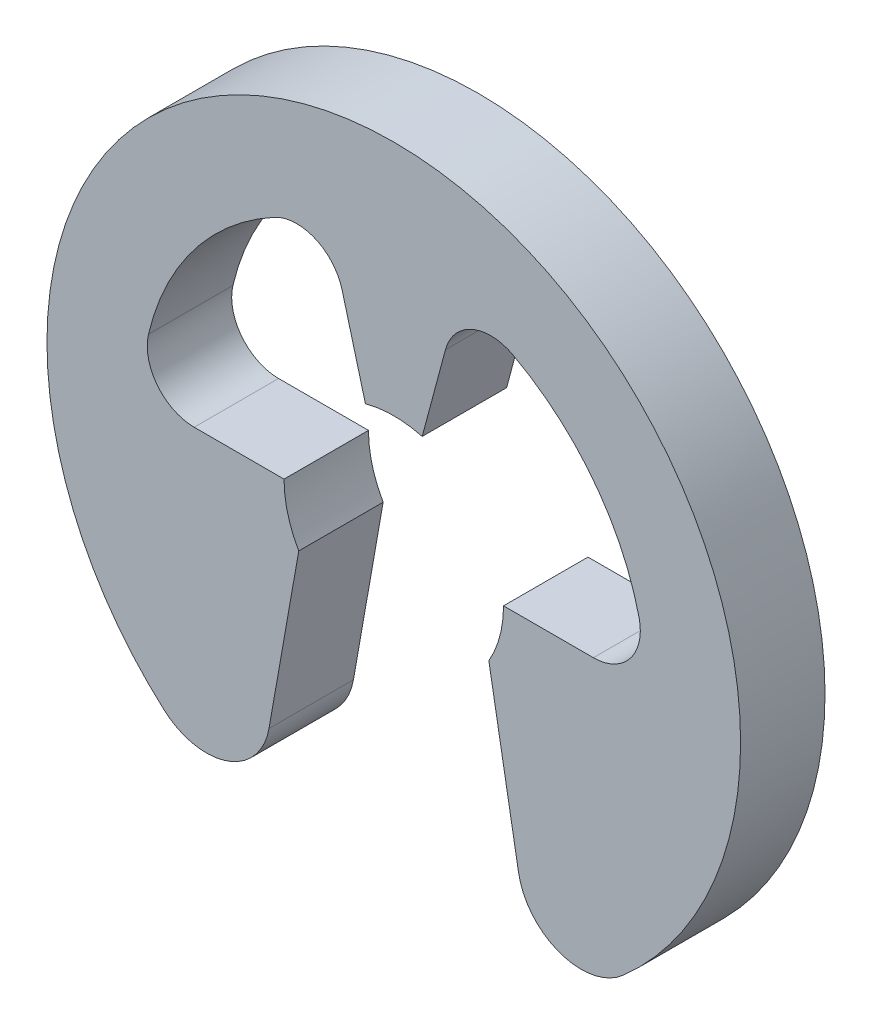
ISO-10303-21;
HEADER;
FILE_DESCRIPTION(('STEP AP214'),'2;1');
FILE_NAME('part.step','',(''),(''),'','','');
FILE_SCHEMA(('AUTOMOTIVE_DESIGN { 1 0 10303 214 1 1 1 1 }'));
ENDSEC;
DATA;
#1=APPLICATION_CONTEXT('core data for automotive mechanical design processes');
#2=APPLICATION_PROTOCOL_DEFINITION('international standard','automotive_design',2000,#1);
#3=PRODUCT_CONTEXT('',#1,'mechanical');
#4=PRODUCT('Part','Part','',(#3));
#5=PRODUCT_RELATED_PRODUCT_CATEGORY('part','',(#4));
#6=PRODUCT_DEFINITION_FORMATION('','',#4);
#7=PRODUCT_DEFINITION_CONTEXT('part definition',#1,'design');
#8=PRODUCT_DEFINITION('design','',#6,#7);
#9=PRODUCT_DEFINITION_SHAPE('','',#8);
#10=(LENGTH_UNIT() NAMED_UNIT(*) SI_UNIT(.MILLI.,.METRE.));
#11=(NAMED_UNIT(*) PLANE_ANGLE_UNIT() SI_UNIT($,.RADIAN.));
#12=(NAMED_UNIT(*) SI_UNIT($,.STERADIAN.) SOLID_ANGLE_UNIT());
#13=UNCERTAINTY_MEASURE_WITH_UNIT(LENGTH_MEASURE(1.E-05),#10,'distance_accuracy_value','');
#14=(GEOMETRIC_REPRESENTATION_CONTEXT(3) GLOBAL_UNCERTAINTY_ASSIGNED_CONTEXT((#13)) GLOBAL_UNIT_ASSIGNED_CONTEXT((#10,
#11,#12)) REPRESENTATION_CONTEXT('',''));
#15=CARTESIAN_POINT('',(0.,0.,0.));
#16=DIRECTION('',(0.,0.,1.));
#17=DIRECTION('',(1.,0.,0.));
#18=AXIS2_PLACEMENT_3D('',#15,#16,#17);
#19=CARTESIAN_POINT('',(0.600538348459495,0.141219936,-0.254));
#20=DIRECTION('',(0.,0.,1.));
#21=DIRECTION('',(1.,0.,0.));
#22=AXIS2_PLACEMENT_3D('',#19,#20,#21);
#23=CYLINDRICAL_SURFACE('',#22,0.141219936);
#24=CARTESIAN_POINT('',(0.600538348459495,0.141219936,0.));
#25=DIRECTION('',(0.,0.,-1.));
#26=DIRECTION('',(1.,0.,0.));
#27=AXIS2_PLACEMENT_3D('',#24,#25,#26);
#28=CIRCLE('',#27,0.141219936);
#29=CARTESIAN_POINT('',(0.73800850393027,0.173546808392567,0.));
#30=VERTEX_POINT('',#29);
#31=CARTESIAN_POINT('',(0.600538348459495,0.,0.));
#32=VERTEX_POINT('',#31);
#33=EDGE_CURVE('E198',#30,#32,#28,.T.);
#34=ORIENTED_EDGE('',*,*,#33,.F.);
#35=DIRECTION('',(0.,0.,1.));
#36=VECTOR('',#35,1.);
#37=CARTESIAN_POINT('',(0.73800850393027,0.173546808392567,-0.254));
#38=LINE('',#37,#36);
#39=CARTESIAN_POINT('',(0.73800850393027,0.173546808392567,-0.254));
#40=VERTEX_POINT('',#39);
#41=EDGE_CURVE('E11',#40,#30,#38,.T.);
#42=ORIENTED_EDGE('',*,*,#41,.F.);
#43=CARTESIAN_POINT('',(0.600538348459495,0.141219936,-0.254));
#44=DIRECTION('',(0.,0.,-1.));
#45=DIRECTION('',(1.,0.,0.));
#46=AXIS2_PLACEMENT_3D('',#43,#44,#45);
#47=CIRCLE('',#46,0.141219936);
#48=CARTESIAN_POINT('',(0.600538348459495,0.,-0.254));
#49=VERTEX_POINT('',#48);
#50=EDGE_CURVE('E248',#40,#49,#47,.T.);
#51=ORIENTED_EDGE('',*,*,#50,.T.);
#52=DIRECTION('',(0.,0.,1.));
#53=VECTOR('',#52,1.);
#54=CARTESIAN_POINT('',(0.600538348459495,0.,-0.254));
#55=LINE('',#54,#53);
#56=EDGE_CURVE('E45',#49,#32,#55,.T.);
#57=ORIENTED_EDGE('',*,*,#56,.T.);
#58=EDGE_LOOP('',(#34,#42,#51,#57));
#59=FACE_BOUND('',#58,.T.);
#60=ADVANCED_FACE('F39',(#59),#23,.F.);
#61=CARTESIAN_POINT('',(0.,0.,-0.254));
#62=DIRECTION('',(0.,0.,1.));
#63=DIRECTION('',(1.,0.,0.));
#64=AXIS2_PLACEMENT_3D('',#61,#62,#63);
#65=CYLINDRICAL_SURFACE('',#64,0.758139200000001);
#66=CARTESIAN_POINT('',(0.,0.,0.));
#67=DIRECTION('',(0.,0.,-1.));
#68=DIRECTION('',(1.,0.,0.));
#69=AXIS2_PLACEMENT_3D('',#66,#67,#68);
#70=CIRCLE('',#69,0.758139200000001);
#71=CARTESIAN_POINT('',(0.358644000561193,0.667944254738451,0.));
#72=VERTEX_POINT('',#71);
#73=EDGE_CURVE('E243',#72,#30,#70,.T.);
#74=ORIENTED_EDGE('',*,*,#73,.F.);
#75=DIRECTION('',(0.,0.,1.));
#76=VECTOR('',#75,1.);
#77=CARTESIAN_POINT('',(0.358644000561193,0.667944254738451,-0.254));
#78=LINE('',#77,#76);
#79=CARTESIAN_POINT('',(0.358644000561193,0.667944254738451,-0.254));
#80=VERTEX_POINT('',#79);
#81=EDGE_CURVE('E48',#80,#72,#78,.T.);
#82=ORIENTED_EDGE('',*,*,#81,.F.);
#83=CARTESIAN_POINT('',(0.,0.,-0.254));
#84=DIRECTION('',(0.,0.,-1.));
#85=DIRECTION('',(1.,0.,0.));
#86=AXIS2_PLACEMENT_3D('',#83,#84,#85);
#87=CIRCLE('',#86,0.758139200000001);
#88=EDGE_CURVE('E186',#80,#40,#87,.T.);
#89=ORIENTED_EDGE('',*,*,#88,.T.);
#90=ORIENTED_EDGE('',*,*,#41,.T.);
#91=EDGE_LOOP('',(#74,#82,#89,#90));
#92=FACE_BOUND('',#91,.T.);
#93=ADVANCED_FACE('F279',(#92),#65,.F.);
#94=CARTESIAN_POINT('',(0.291838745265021,0.543525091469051,-0.254));
#95=DIRECTION('',(0.,0.,1.));
#96=DIRECTION('',(1.,0.,0.));
#97=AXIS2_PLACEMENT_3D('',#94,#95,#96);
#98=CYLINDRICAL_SURFACE('',#97,0.141219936);
#99=CARTESIAN_POINT('',(0.291838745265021,0.543525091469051,0.));
#100=DIRECTION('',(0.,0.,-1.));
#101=DIRECTION('',(1.,0.,0.));
#102=AXIS2_PLACEMENT_3D('',#99,#100,#101);
#103=CIRCLE('',#102,0.141219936);
#104=CARTESIAN_POINT('',(0.155430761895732,0.580075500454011,0.));
#105=VERTEX_POINT('',#104);
#106=EDGE_CURVE('E174',#105,#72,#103,.T.);
#107=ORIENTED_EDGE('',*,*,#106,.F.);
#108=DIRECTION('',(0.,0.,1.));
#109=VECTOR('',#108,1.);
#110=CARTESIAN_POINT('',(0.155430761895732,0.580075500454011,-0.254));
#111=LINE('',#110,#109);
#112=CARTESIAN_POINT('',(0.155430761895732,0.580075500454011,-0.254));
#113=VERTEX_POINT('',#112);
#114=EDGE_CURVE('E169',#113,#105,#111,.T.);
#115=ORIENTED_EDGE('',*,*,#114,.F.);
#116=CARTESIAN_POINT('',(0.291838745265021,0.543525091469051,-0.254));
#117=DIRECTION('',(0.,0.,-1.));
#118=DIRECTION('',(1.,0.,0.));
#119=AXIS2_PLACEMENT_3D('',#116,#117,#118);
#120=CIRCLE('',#119,0.141219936);
#121=EDGE_CURVE('E171',#113,#80,#120,.T.);
#122=ORIENTED_EDGE('',*,*,#121,.T.);
#123=ORIENTED_EDGE('',*,*,#81,.T.);
#124=EDGE_LOOP('',(#107,#115,#122,#123));
#125=FACE_BOUND('',#124,.T.);
#126=ADVANCED_FACE('F168',(#125),#98,.F.);
#127=CARTESIAN_POINT('',(0.0854620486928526,0.31894870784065,-0.254));
#128=DIRECTION('',(0.965925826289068,-0.258819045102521,0.));
#129=DIRECTION('',(0.258819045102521,0.965925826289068,0.));
#130=AXIS2_PLACEMENT_3D('',#127,#128,#129);
#131=PLANE('',#130);
#132=DIRECTION('',(0.258819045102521,0.965925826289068,0.));
#133=VECTOR('',#132,1.);
#134=CARTESIAN_POINT('',(0.0854620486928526,0.31894870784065,0.));
#135=LINE('',#134,#133);
#136=CARTESIAN_POINT('',(0.0854620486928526,0.31894870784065,0.));
#137=VERTEX_POINT('',#136);
#138=EDGE_CURVE('E241',#137,#105,#135,.T.);
#139=ORIENTED_EDGE('',*,*,#138,.F.);
#140=DIRECTION('',(0.,0.,1.));
#141=VECTOR('',#140,1.);
#142=CARTESIAN_POINT('',(0.0854620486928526,0.31894870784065,-0.254));
#143=LINE('',#142,#141);
#144=CARTESIAN_POINT('',(0.0854620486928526,0.31894870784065,-0.254));
#145=VERTEX_POINT('',#144);
#146=EDGE_CURVE('E177',#145,#137,#143,.T.);
#147=ORIENTED_EDGE('',*,*,#146,.F.);
#148=DIRECTION('',(0.258819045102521,0.965925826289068,0.));
#149=VECTOR('',#148,1.);
#150=CARTESIAN_POINT('',(0.0854620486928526,0.31894870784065,-0.254));
#151=LINE('',#150,#149);
#152=EDGE_CURVE('E184',#145,#113,#151,.T.);
#153=ORIENTED_EDGE('',*,*,#152,.T.);
#154=ORIENTED_EDGE('',*,*,#114,.T.);
#155=EDGE_LOOP('',(#139,#147,#153,#154));
#156=FACE_BOUND('',#155,.T.);
#157=ADVANCED_FACE('F187',(#156),#131,.T.);
#158=CARTESIAN_POINT('',(0.,0.,-0.254));
#159=DIRECTION('',(0.,0.,1.));
#160=DIRECTION('',(1.,0.,0.));
#161=AXIS2_PLACEMENT_3D('',#158,#159,#160);
#162=CYLINDRICAL_SURFACE('',#161,0.3302);
#163=CARTESIAN_POINT('',(0.,0.,0.));
#164=DIRECTION('',(0.,0.,-1.));
#165=DIRECTION('',(-1.,0.,0.));
#166=AXIS2_PLACEMENT_3D('',#163,#164,#165);
#167=CIRCLE('',#166,0.3302);
#168=CARTESIAN_POINT('',(-0.0854620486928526,0.31894870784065,0.));
#169=VERTEX_POINT('',#168);
#170=EDGE_CURVE('E236',#169,#137,#167,.T.);
#171=ORIENTED_EDGE('',*,*,#170,.F.);
#172=DIRECTION('',(0.,0.,1.));
#173=VECTOR('',#172,1.);
#174=CARTESIAN_POINT('',(-0.0854620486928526,0.31894870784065,-0.254));
#175=LINE('',#174,#173);
#176=CARTESIAN_POINT('',(-0.0854620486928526,0.31894870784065,-0.254));
#177=VERTEX_POINT('',#176);
#178=EDGE_CURVE('E247',#177,#169,#175,.T.);
#179=ORIENTED_EDGE('',*,*,#178,.F.);
#180=CARTESIAN_POINT('',(0.,0.,-0.254));
#181=DIRECTION('',(0.,0.,-1.));
#182=DIRECTION('',(-1.,0.,0.));
#183=AXIS2_PLACEMENT_3D('',#180,#181,#182);
#184=CIRCLE('',#183,0.3302);
#185=EDGE_CURVE('E188',#177,#145,#184,.T.);
#186=ORIENTED_EDGE('',*,*,#185,.T.);
#187=ORIENTED_EDGE('',*,*,#146,.T.);
#188=EDGE_LOOP('',(#171,#179,#186,#187));
#189=FACE_BOUND('',#188,.T.);
#190=ADVANCED_FACE('F292',(#189),#162,.F.);
#191=CARTESIAN_POINT('',(-0.0854620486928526,0.31894870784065,-0.254));
#192=DIRECTION('',(-0.965925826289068,-0.258819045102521,0.));
#193=DIRECTION('',(0.258819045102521,-0.965925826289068,0.));
#194=AXIS2_PLACEMENT_3D('',#191,#192,#193);
#195=PLANE('',#194);
#196=DIRECTION('',(0.258819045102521,-0.965925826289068,0.));
#197=VECTOR('',#196,1.);
#198=CARTESIAN_POINT('',(-0.0854620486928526,0.31894870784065,0.));
#199=LINE('',#198,#197);
#200=CARTESIAN_POINT('',(-0.155430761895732,0.580075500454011,0.));
#201=VERTEX_POINT('',#200);
#202=EDGE_CURVE('E231',#201,#169,#199,.T.);
#203=ORIENTED_EDGE('',*,*,#202,.F.);
#204=DIRECTION('',(0.,0.,1.));
#205=VECTOR('',#204,1.);
#206=CARTESIAN_POINT('',(-0.155430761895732,0.580075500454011,-0.254));
#207=LINE('',#206,#205);
#208=CARTESIAN_POINT('',(-0.155430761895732,0.580075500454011,-0.254));
#209=VERTEX_POINT('',#208);
#210=EDGE_CURVE('E252',#209,#201,#207,.T.);
#211=ORIENTED_EDGE('',*,*,#210,.F.);
#212=DIRECTION('',(0.258819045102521,-0.965925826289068,0.));
#213=VECTOR('',#212,1.);
#214=CARTESIAN_POINT('',(-0.0854620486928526,0.31894870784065,-0.254));
#215=LINE('',#214,#213);
#216=EDGE_CURVE('E193',#209,#177,#215,.T.);
#217=ORIENTED_EDGE('',*,*,#216,.T.);
#218=ORIENTED_EDGE('',*,*,#178,.T.);
#219=EDGE_LOOP('',(#203,#211,#217,#218));
#220=FACE_BOUND('',#219,.T.);
#221=ADVANCED_FACE('F294',(#220),#195,.T.);
#222=CARTESIAN_POINT('',(-0.291838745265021,0.543525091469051,-0.254));
#223=DIRECTION('',(0.,0.,1.));
#224=DIRECTION('',(1.,0.,0.));
#225=AXIS2_PLACEMENT_3D('',#222,#223,#224);
#226=CYLINDRICAL_SURFACE('',#225,0.141219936);
#227=CARTESIAN_POINT('',(-0.291838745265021,0.543525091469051,0.));
#228=DIRECTION('',(0.,0.,-1.));
#229=DIRECTION('',(1.,0.,0.));
#230=AXIS2_PLACEMENT_3D('',#227,#228,#229);
#231=CIRCLE('',#230,0.141219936);
#232=CARTESIAN_POINT('',(-0.358644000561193,0.667944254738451,0.));
#233=VERTEX_POINT('',#232);
#234=EDGE_CURVE('E234',#233,#201,#231,.T.);
#235=ORIENTED_EDGE('',*,*,#234,.F.);
#236=DIRECTION('',(0.,0.,1.));
#237=VECTOR('',#236,1.);
#238=CARTESIAN_POINT('',(-0.358644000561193,0.667944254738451,-0.254));
#239=LINE('',#238,#237);
#240=CARTESIAN_POINT('',(-0.358644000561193,0.667944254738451,-0.254));
#241=VERTEX_POINT('',#240);
#242=EDGE_CURVE('E255',#241,#233,#239,.T.);
#243=ORIENTED_EDGE('',*,*,#242,.F.);
#244=CARTESIAN_POINT('',(-0.291838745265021,0.543525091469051,-0.254));
#245=DIRECTION('',(0.,0.,-1.));
#246=DIRECTION('',(1.,0.,0.));
#247=AXIS2_PLACEMENT_3D('',#244,#245,#246);
#248=CIRCLE('',#247,0.141219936);
#249=EDGE_CURVE('E465',#241,#209,#248,.T.);
#250=ORIENTED_EDGE('',*,*,#249,.T.);
#251=ORIENTED_EDGE('',*,*,#210,.T.);
#252=EDGE_LOOP('',(#235,#243,#250,#251));
#253=FACE_BOUND('',#252,.T.);
#254=ADVANCED_FACE('F297',(#253),#226,.F.);
#255=CARTESIAN_POINT('',(0.,0.,-0.254));
#256=DIRECTION('',(0.,0.,1.));
#257=DIRECTION('',(1.,0.,0.));
#258=AXIS2_PLACEMENT_3D('',#255,#256,#257);
#259=CYLINDRICAL_SURFACE('',#258,0.758139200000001);
#260=CARTESIAN_POINT('',(0.,0.,0.));
#261=DIRECTION('',(0.,0.,-1.));
#262=DIRECTION('',(1.,0.,0.));
#263=AXIS2_PLACEMENT_3D('',#260,#261,#262);
#264=CIRCLE('',#263,0.758139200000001);
#265=CARTESIAN_POINT('',(-0.73800850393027,0.173546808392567,0.));
#266=VERTEX_POINT('',#265);
#267=EDGE_CURVE('E228',#266,#233,#264,.T.);
#268=ORIENTED_EDGE('',*,*,#267,.F.);
#269=DIRECTION('',(0.,0.,1.));
#270=VECTOR('',#269,1.);
#271=CARTESIAN_POINT('',(-0.73800850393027,0.173546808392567,-0.254));
#272=LINE('',#271,#270);
#273=CARTESIAN_POINT('',(-0.73800850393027,0.173546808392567,-0.254));
#274=VERTEX_POINT('',#273);
#275=EDGE_CURVE('E258',#274,#266,#272,.T.);
#276=ORIENTED_EDGE('',*,*,#275,.F.);
#277=CARTESIAN_POINT('',(0.,0.,-0.254));
#278=DIRECTION('',(0.,0.,-1.));
#279=DIRECTION('',(1.,0.,0.));
#280=AXIS2_PLACEMENT_3D('',#277,#278,#279);
#281=CIRCLE('',#280,0.758139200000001);
#282=EDGE_CURVE('E468',#274,#241,#281,.T.);
#283=ORIENTED_EDGE('',*,*,#282,.T.);
#284=ORIENTED_EDGE('',*,*,#242,.T.);
#285=EDGE_LOOP('',(#268,#276,#283,#284));
#286=FACE_BOUND('',#285,.T.);
#287=ADVANCED_FACE('F305',(#286),#259,.F.);
#288=CARTESIAN_POINT('',(-0.600538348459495,0.141219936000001,-0.254));
#289=DIRECTION('',(0.,0.,1.));
#290=DIRECTION('',(1.,0.,0.));
#291=AXIS2_PLACEMENT_3D('',#288,#289,#290);
#292=CYLINDRICAL_SURFACE('',#291,0.141219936);
#293=CARTESIAN_POINT('',(-0.600538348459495,0.141219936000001,0.));
#294=DIRECTION('',(0.,0.,-1.));
#295=DIRECTION('',(1.,0.,0.));
#296=AXIS2_PLACEMENT_3D('',#293,#294,#295);
#297=CIRCLE('',#296,0.141219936);
#298=CARTESIAN_POINT('',(-0.600538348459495,0.,0.));
#299=VERTEX_POINT('',#298);
#300=EDGE_CURVE('E226',#299,#266,#297,.T.);
#301=ORIENTED_EDGE('',*,*,#300,.F.);
#302=DIRECTION('',(0.,0.,1.));
#303=VECTOR('',#302,1.);
#304=CARTESIAN_POINT('',(-0.600538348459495,0.,-0.254));
#305=LINE('',#304,#303);
#306=CARTESIAN_POINT('',(-0.600538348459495,0.,-0.254));
#307=VERTEX_POINT('',#306);
#308=EDGE_CURVE('E256',#307,#299,#305,.T.);
#309=ORIENTED_EDGE('',*,*,#308,.F.);
#310=CARTESIAN_POINT('',(-0.600538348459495,0.141219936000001,-0.254));
#311=DIRECTION('',(0.,0.,-1.));
#312=DIRECTION('',(1.,0.,0.));
#313=AXIS2_PLACEMENT_3D('',#310,#311,#312);
#314=CIRCLE('',#313,0.141219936);
#315=EDGE_CURVE('E451',#307,#274,#314,.T.);
#316=ORIENTED_EDGE('',*,*,#315,.T.);
#317=ORIENTED_EDGE('',*,*,#275,.T.);
#318=EDGE_LOOP('',(#301,#309,#316,#317));
#319=FACE_BOUND('',#318,.T.);
#320=ADVANCED_FACE('F308',(#319),#292,.F.);
#321=CARTESIAN_POINT('',(-0.3302,0.,-0.254));
#322=DIRECTION('',(0.,1.,0.));
#323=DIRECTION('',(-1.,0.,0.));
#324=AXIS2_PLACEMENT_3D('',#321,#322,#323);
#325=PLANE('',#324);
#326=DIRECTION('',(-1.,0.,0.));
#327=VECTOR('',#326,1.);
#328=CARTESIAN_POINT('',(-0.3302,0.,0.));
#329=LINE('',#328,#327);
#330=CARTESIAN_POINT('',(-0.3302,0.,0.));
#331=VERTEX_POINT('',#330);
#332=EDGE_CURVE('E224',#331,#299,#329,.T.);
#333=ORIENTED_EDGE('',*,*,#332,.F.);
#334=DIRECTION('',(0.,0.,1.));
#335=VECTOR('',#334,1.);
#336=CARTESIAN_POINT('',(-0.3302,0.,-0.254));
#337=LINE('',#336,#335);
#338=CARTESIAN_POINT('',(-0.3302,0.,-0.254));
#339=VERTEX_POINT('',#338);
#340=EDGE_CURVE('E257',#339,#331,#337,.T.);
#341=ORIENTED_EDGE('',*,*,#340,.F.);
#342=DIRECTION('',(-1.,0.,0.));
#343=VECTOR('',#342,1.);
#344=CARTESIAN_POINT('',(-0.3302,0.,-0.254));
#345=LINE('',#344,#343);
#346=EDGE_CURVE('E453',#339,#307,#345,.T.);
#347=ORIENTED_EDGE('',*,*,#346,.T.);
#348=ORIENTED_EDGE('',*,*,#308,.T.);
#349=EDGE_LOOP('',(#333,#341,#347,#348));
#350=FACE_BOUND('',#349,.T.);
#351=ADVANCED_FACE('F309',(#350),#325,.T.);
#352=CARTESIAN_POINT('',(0.,0.,-0.254));
#353=DIRECTION('',(0.,0.,1.));
#354=DIRECTION('',(1.,0.,0.));
#355=AXIS2_PLACEMENT_3D('',#352,#353,#354);
#356=CYLINDRICAL_SURFACE('',#355,0.3302);
#357=CARTESIAN_POINT('',(0.,0.,0.));
#358=DIRECTION('',(0.,0.,-1.));
#359=DIRECTION('',(1.,0.,0.));
#360=AXIS2_PLACEMENT_3D('',#357,#358,#359);
#361=CIRCLE('',#360,0.3302);
#362=CARTESIAN_POINT('',(-0.285961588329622,-0.1651,0.));
#363=VERTEX_POINT('',#362);
#364=EDGE_CURVE('E219',#363,#331,#361,.T.);
#365=ORIENTED_EDGE('',*,*,#364,.F.);
#366=DIRECTION('',(0.,0.,1.));
#367=VECTOR('',#366,1.);
#368=CARTESIAN_POINT('',(-0.285961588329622,-0.1651,-0.254));
#369=LINE('',#368,#367);
#370=CARTESIAN_POINT('',(-0.285961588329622,-0.1651,-0.254));
#371=VERTEX_POINT('',#370);
#372=EDGE_CURVE('E265',#371,#363,#369,.T.);
#373=ORIENTED_EDGE('',*,*,#372,.F.);
#374=CARTESIAN_POINT('',(0.,0.,-0.254));
#375=DIRECTION('',(0.,0.,-1.));
#376=DIRECTION('',(1.,0.,0.));
#377=AXIS2_PLACEMENT_3D('',#374,#375,#376);
#378=CIRCLE('',#377,0.3302);
#379=EDGE_CURVE('E472',#371,#339,#378,.T.);
#380=ORIENTED_EDGE('',*,*,#379,.T.);
#381=ORIENTED_EDGE('',*,*,#340,.T.);
#382=EDGE_LOOP('',(#365,#373,#380,#381));
#383=FACE_BOUND('',#382,.T.);
#384=ADVANCED_FACE('F314',(#383),#356,.F.);
#385=CARTESIAN_POINT('',(-0.285961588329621,-0.1651,-0.254));
#386=DIRECTION('',(0.984807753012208,-0.17364817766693,0.));
#387=DIRECTION('',(0.17364817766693,0.984807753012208,0.));
#388=AXIS2_PLACEMENT_3D('',#385,#386,#387);
#389=PLANE('',#388);
#390=DIRECTION('',(0.17364817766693,0.984807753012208,0.));
#391=VECTOR('',#390,1.);
#392=CARTESIAN_POINT('',(-0.285961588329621,-0.1651,0.));
#393=LINE('',#392,#391);
#394=CARTESIAN_POINT('',(-0.375423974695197,-0.672466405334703,0.));
#395=VERTEX_POINT('',#394);
#396=EDGE_CURVE('E220',#395,#363,#393,.T.);
#397=ORIENTED_EDGE('',*,*,#396,.F.);
#398=DIRECTION('',(0.,0.,1.));
#399=VECTOR('',#398,1.);
#400=CARTESIAN_POINT('',(-0.375423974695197,-0.672466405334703,-0.254));
#401=LINE('',#400,#399);
#402=CARTESIAN_POINT('',(-0.375423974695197,-0.672466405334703,-0.254));
#403=VERTEX_POINT('',#402);
#404=EDGE_CURVE('E262',#403,#395,#401,.T.);
#405=ORIENTED_EDGE('',*,*,#404,.F.);
#406=DIRECTION('',(0.17364817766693,0.984807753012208,0.));
#407=VECTOR('',#406,1.);
#408=CARTESIAN_POINT('',(-0.285961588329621,-0.1651,-0.254));
#409=LINE('',#408,#407);
#410=EDGE_CURVE('E441',#403,#371,#409,.T.);
#411=ORIENTED_EDGE('',*,*,#410,.T.);
#412=ORIENTED_EDGE('',*,*,#372,.T.);
#413=EDGE_LOOP('',(#397,#405,#411,#412));
#414=FACE_BOUND('',#413,.T.);
#415=ADVANCED_FACE('F318',(#414),#389,.T.);
#416=CARTESIAN_POINT('',(-0.563666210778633,-0.639274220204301,-0.254));
#417=DIRECTION('',(0.,0.,1.));
#418=DIRECTION('',(1.,0.,0.));
#419=AXIS2_PLACEMENT_3D('',#416,#417,#418);
#420=CYLINDRICAL_SURFACE('',#419,0.191146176);
#421=CARTESIAN_POINT('',(-0.563666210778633,-0.639274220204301,0.));
#422=DIRECTION('',(0.,0.,1.));
#423=DIRECTION('',(1.,0.,0.));
#424=AXIS2_PLACEMENT_3D('',#421,#422,#423);
#425=CIRCLE('',#424,0.191146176);
#426=CARTESIAN_POINT('',(-0.690082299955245,-0.782647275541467,0.));
#427=VERTEX_POINT('',#426);
#428=EDGE_CURVE('E212',#427,#395,#425,.T.);
#429=ORIENTED_EDGE('',*,*,#428,.F.);
#430=DIRECTION('',(0.,0.,1.));
#431=VECTOR('',#430,1.);
#432=CARTESIAN_POINT('',(-0.690082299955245,-0.782647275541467,-0.254));
#433=LINE('',#432,#431);
#434=CARTESIAN_POINT('',(-0.690082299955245,-0.782647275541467,-0.254));
#435=VERTEX_POINT('',#434);
#436=EDGE_CURVE('E266',#435,#427,#433,.T.);
#437=ORIENTED_EDGE('',*,*,#436,.F.);
#438=CARTESIAN_POINT('',(-0.563666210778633,-0.639274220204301,-0.254));
#439=DIRECTION('',(0.,0.,1.));
#440=DIRECTION('',(1.,0.,0.));
#441=AXIS2_PLACEMENT_3D('',#438,#439,#440);
#442=CIRCLE('',#441,0.191146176);
#443=EDGE_CURVE('E439',#435,#403,#442,.T.);
#444=ORIENTED_EDGE('',*,*,#443,.T.);
#445=ORIENTED_EDGE('',*,*,#404,.T.);
#446=EDGE_LOOP('',(#429,#437,#444,#445));
#447=FACE_BOUND('',#446,.T.);
#448=ADVANCED_FACE('F325',(#447),#420,.T.);
#449=CARTESIAN_POINT('',(0.,0.,-0.254));
#450=DIRECTION('',(0.,0.,1.));
#451=DIRECTION('',(1.,0.,0.));
#452=AXIS2_PLACEMENT_3D('',#449,#450,#451);
#453=CYLINDRICAL_SURFACE('',#452,1.043432);
#454=CARTESIAN_POINT('',(0.,0.,0.));
#455=DIRECTION('',(0.,0.,1.));
#456=DIRECTION('',(1.,0.,0.));
#457=AXIS2_PLACEMENT_3D('',#454,#455,#456);
#458=CIRCLE('',#457,1.043432);
#459=CARTESIAN_POINT('',(0.690082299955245,-0.782647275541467,0.));
#460=VERTEX_POINT('',#459);
#461=EDGE_CURVE('E211',#460,#427,#458,.T.);
#462=ORIENTED_EDGE('',*,*,#461,.F.);
#463=DIRECTION('',(0.,0.,1.));
#464=VECTOR('',#463,1.);
#465=CARTESIAN_POINT('',(0.690082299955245,-0.782647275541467,-0.254));
#466=LINE('',#465,#464);
#467=CARTESIAN_POINT('',(0.690082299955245,-0.782647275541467,-0.254));
#468=VERTEX_POINT('',#467);
#469=EDGE_CURVE('E268',#468,#460,#466,.T.);
#470=ORIENTED_EDGE('',*,*,#469,.F.);
#471=CARTESIAN_POINT('',(0.,0.,-0.254));
#472=DIRECTION('',(0.,0.,1.));
#473=DIRECTION('',(1.,0.,0.));
#474=AXIS2_PLACEMENT_3D('',#471,#472,#473);
#475=CIRCLE('',#474,1.043432);
#476=EDGE_CURVE('E478',#468,#435,#475,.T.);
#477=ORIENTED_EDGE('',*,*,#476,.T.);
#478=ORIENTED_EDGE('',*,*,#436,.T.);
#479=EDGE_LOOP('',(#462,#470,#477,#478));
#480=FACE_BOUND('',#479,.T.);
#481=ADVANCED_FACE('F326',(#480),#453,.T.);
#482=CARTESIAN_POINT('',(0.563666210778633,-0.639274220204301,-0.254));
#483=DIRECTION('',(0.,0.,1.));
#484=DIRECTION('',(1.,0.,0.));
#485=AXIS2_PLACEMENT_3D('',#482,#483,#484);
#486=CYLINDRICAL_SURFACE('',#485,0.191146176);
#487=CARTESIAN_POINT('',(0.563666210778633,-0.639274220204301,0.));
#488=DIRECTION('',(0.,0.,1.));
#489=DIRECTION('',(1.,0.,0.));
#490=AXIS2_PLACEMENT_3D('',#487,#488,#489);
#491=CIRCLE('',#490,0.191146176);
#492=CARTESIAN_POINT('',(0.375423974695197,-0.672466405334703,0.));
#493=VERTEX_POINT('',#492);
#494=EDGE_CURVE('E208',#493,#460,#491,.T.);
#495=ORIENTED_EDGE('',*,*,#494,.F.);
#496=DIRECTION('',(0.,0.,1.));
#497=VECTOR('',#496,1.);
#498=CARTESIAN_POINT('',(0.375423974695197,-0.672466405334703,-0.254));
#499=LINE('',#498,#497);
#500=CARTESIAN_POINT('',(0.375423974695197,-0.672466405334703,-0.254));
#501=VERTEX_POINT('',#500);
#502=EDGE_CURVE('E269',#501,#493,#499,.T.);
#503=ORIENTED_EDGE('',*,*,#502,.F.);
#504=CARTESIAN_POINT('',(0.563666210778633,-0.639274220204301,-0.254));
#505=DIRECTION('',(0.,0.,1.));
#506=DIRECTION('',(1.,0.,0.));
#507=AXIS2_PLACEMENT_3D('',#504,#505,#506);
#508=CIRCLE('',#507,0.191146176);
#509=EDGE_CURVE('E433',#501,#468,#508,.T.);
#510=ORIENTED_EDGE('',*,*,#509,.T.);
#511=ORIENTED_EDGE('',*,*,#469,.T.);
#512=EDGE_LOOP('',(#495,#503,#510,#511));
#513=FACE_BOUND('',#512,.T.);
#514=ADVANCED_FACE('F329',(#513),#486,.T.);
#515=CARTESIAN_POINT('',(0.285961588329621,-0.1651,-0.254));
#516=DIRECTION('',(-0.984807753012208,-0.17364817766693,0.));
#517=DIRECTION('',(0.17364817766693,-0.984807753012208,0.));
#518=AXIS2_PLACEMENT_3D('',#515,#516,#517);
#519=PLANE('',#518);
#520=DIRECTION('',(0.17364817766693,-0.984807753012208,0.));
#521=VECTOR('',#520,1.);
#522=CARTESIAN_POINT('',(0.285961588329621,-0.1651,0.));
#523=LINE('',#522,#521);
#524=CARTESIAN_POINT('',(0.285961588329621,-0.1651,0.));
#525=VERTEX_POINT('',#524);
#526=EDGE_CURVE('E202',#525,#493,#523,.T.);
#527=ORIENTED_EDGE('',*,*,#526,.F.);
#528=DIRECTION('',(0.,0.,1.));
#529=VECTOR('',#528,1.);
#530=CARTESIAN_POINT('',(0.285961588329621,-0.1651,-0.254));
#531=LINE('',#530,#529);
#532=CARTESIAN_POINT('',(0.285961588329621,-0.1651,-0.254));
#533=VERTEX_POINT('',#532);
#534=EDGE_CURVE('E275',#533,#525,#531,.T.);
#535=ORIENTED_EDGE('',*,*,#534,.F.);
#536=DIRECTION('',(0.17364817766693,-0.984807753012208,0.));
#537=VECTOR('',#536,1.);
#538=CARTESIAN_POINT('',(0.285961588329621,-0.1651,-0.254));
#539=LINE('',#538,#537);
#540=EDGE_CURVE('E427',#533,#501,#539,.T.);
#541=ORIENTED_EDGE('',*,*,#540,.T.);
#542=ORIENTED_EDGE('',*,*,#502,.T.);
#543=EDGE_LOOP('',(#527,#535,#541,#542));
#544=FACE_BOUND('',#543,.T.);
#545=ADVANCED_FACE('F331',(#544),#519,.T.);
#546=CARTESIAN_POINT('',(0.,0.,-0.254));
#547=DIRECTION('',(0.,0.,1.));
#548=DIRECTION('',(1.,0.,0.));
#549=AXIS2_PLACEMENT_3D('',#546,#547,#548);
#550=CYLINDRICAL_SURFACE('',#549,0.3302);
#551=CARTESIAN_POINT('',(0.,0.,0.));
#552=DIRECTION('',(0.,0.,-1.));
#553=DIRECTION('',(1.,0.,0.));
#554=AXIS2_PLACEMENT_3D('',#551,#552,#553);
#555=CIRCLE('',#554,0.3302);
#556=CARTESIAN_POINT('',(0.3302,0.,0.));
#557=VERTEX_POINT('',#556);
#558=EDGE_CURVE('E205',#557,#525,#555,.T.);
#559=ORIENTED_EDGE('',*,*,#558,.F.);
#560=DIRECTION('',(0.,0.,1.));
#561=VECTOR('',#560,1.);
#562=CARTESIAN_POINT('',(0.3302,0.,-0.254));
#563=LINE('',#562,#561);
#564=CARTESIAN_POINT('',(0.3302,0.,-0.254));
#565=VERTEX_POINT('',#564);
#566=EDGE_CURVE('E272',#565,#557,#563,.T.);
#567=ORIENTED_EDGE('',*,*,#566,.F.);
#568=CARTESIAN_POINT('',(0.,0.,-0.254));
#569=DIRECTION('',(0.,0.,-1.));
#570=DIRECTION('',(1.,0.,0.));
#571=AXIS2_PLACEMENT_3D('',#568,#569,#570);
#572=CIRCLE('',#571,0.3302);
#573=EDGE_CURVE('E477',#565,#533,#572,.T.);
#574=ORIENTED_EDGE('',*,*,#573,.T.);
#575=ORIENTED_EDGE('',*,*,#534,.T.);
#576=EDGE_LOOP('',(#559,#567,#574,#575));
#577=FACE_BOUND('',#576,.T.);
#578=ADVANCED_FACE('F339',(#577),#550,.F.);
#579=CARTESIAN_POINT('',(0.3302,0.,-0.254));
#580=DIRECTION('',(0.,1.,0.));
#581=DIRECTION('',(0.,0.,1.));
#582=AXIS2_PLACEMENT_3D('',#579,#580,#581);
#583=PLANE('',#582);
#584=DIRECTION('',(-1.,0.,0.));
#585=VECTOR('',#584,1.);
#586=CARTESIAN_POINT('',(0.3302,0.,0.));
#587=LINE('',#586,#585);
#588=EDGE_CURVE('E200',#32,#557,#587,.T.);
#589=ORIENTED_EDGE('',*,*,#588,.F.);
#590=ORIENTED_EDGE('',*,*,#56,.F.);
#591=DIRECTION('',(-1.,0.,0.));
#592=VECTOR('',#591,1.);
#593=CARTESIAN_POINT('',(0.3302,0.,-0.254));
#594=LINE('',#593,#592);
#595=EDGE_CURVE('E485',#49,#565,#594,.T.);
#596=ORIENTED_EDGE('',*,*,#595,.T.);
#597=ORIENTED_EDGE('',*,*,#566,.T.);
#598=EDGE_LOOP('',(#589,#590,#596,#597));
#599=FACE_BOUND('',#598,.T.);
#600=ADVANCED_FACE('F274',(#599),#583,.T.);
#601=CARTESIAN_POINT('',(0.600538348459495,0.141219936,-0.254));
#602=DIRECTION('',(0.,0.,1.));
#603=DIRECTION('',(1.,0.,0.));
#604=AXIS2_PLACEMENT_3D('',#601,#602,#603);
#605=PLANE('',#604);
#606=ORIENTED_EDGE('',*,*,#50,.F.);
#607=ORIENTED_EDGE('',*,*,#88,.F.);
#608=ORIENTED_EDGE('',*,*,#121,.F.);
#609=ORIENTED_EDGE('',*,*,#152,.F.);
#610=ORIENTED_EDGE('',*,*,#185,.F.);
#611=ORIENTED_EDGE('',*,*,#216,.F.);
#612=ORIENTED_EDGE('',*,*,#249,.F.);
#613=ORIENTED_EDGE('',*,*,#282,.F.);
#614=ORIENTED_EDGE('',*,*,#315,.F.);
#615=ORIENTED_EDGE('',*,*,#346,.F.);
#616=ORIENTED_EDGE('',*,*,#379,.F.);
#617=ORIENTED_EDGE('',*,*,#410,.F.);
#618=ORIENTED_EDGE('',*,*,#443,.F.);
#619=ORIENTED_EDGE('',*,*,#476,.F.);
#620=ORIENTED_EDGE('',*,*,#509,.F.);
#621=ORIENTED_EDGE('',*,*,#540,.F.);
#622=ORIENTED_EDGE('',*,*,#573,.F.);
#623=ORIENTED_EDGE('',*,*,#595,.F.);
#624=EDGE_LOOP('',(#606,#607,#608,#609,#610,#611,#612,#613,#614,#615,#616,#617,#618,#619,#620,
#621,#622,#623));
#625=FACE_BOUND('',#624,.T.);
#626=ADVANCED_FACE('F185',(#625),#605,.F.);
#627=CARTESIAN_POINT('',(0.600538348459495,0.141219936,0.));
#628=DIRECTION('',(0.,0.,1.));
#629=DIRECTION('',(1.,0.,0.));
#630=AXIS2_PLACEMENT_3D('',#627,#628,#629);
#631=PLANE('',#630);
#632=ORIENTED_EDGE('',*,*,#33,.T.);
#633=ORIENTED_EDGE('',*,*,#588,.T.);
#634=ORIENTED_EDGE('',*,*,#558,.T.);
#635=ORIENTED_EDGE('',*,*,#526,.T.);
#636=ORIENTED_EDGE('',*,*,#494,.T.);
#637=ORIENTED_EDGE('',*,*,#461,.T.);
#638=ORIENTED_EDGE('',*,*,#428,.T.);
#639=ORIENTED_EDGE('',*,*,#396,.T.);
#640=ORIENTED_EDGE('',*,*,#364,.T.);
#641=ORIENTED_EDGE('',*,*,#332,.T.);
#642=ORIENTED_EDGE('',*,*,#300,.T.);
#643=ORIENTED_EDGE('',*,*,#267,.T.);
#644=ORIENTED_EDGE('',*,*,#234,.T.);
#645=ORIENTED_EDGE('',*,*,#202,.T.);
#646=ORIENTED_EDGE('',*,*,#170,.T.);
#647=ORIENTED_EDGE('',*,*,#138,.T.);
#648=ORIENTED_EDGE('',*,*,#106,.T.);
#649=ORIENTED_EDGE('',*,*,#73,.T.);
#650=EDGE_LOOP('',(#632,#633,#634,#635,#636,#637,#638,#639,#640,#641,#642,#643,#644,#645,#646,
#647,#648,#649));
#651=FACE_BOUND('',#650,.T.);
#652=ADVANCED_FACE('F280',(#651),#631,.T.);
#653=CLOSED_SHELL('',(#60,#93,#126,#157,#190,#221,#254,#287,#320,#351,#384,#415,#448,#481,#514,
#545,#578,#600,#626,#652));
#654=MANIFOLD_SOLID_BREP('B2',#653);
#655=ADVANCED_BREP_SHAPE_REPRESENTATION('',(#18,#654),#14);
#656=SHAPE_DEFINITION_REPRESENTATION(#9,#655);
ENDSEC;
END-ISO-10303-21;
